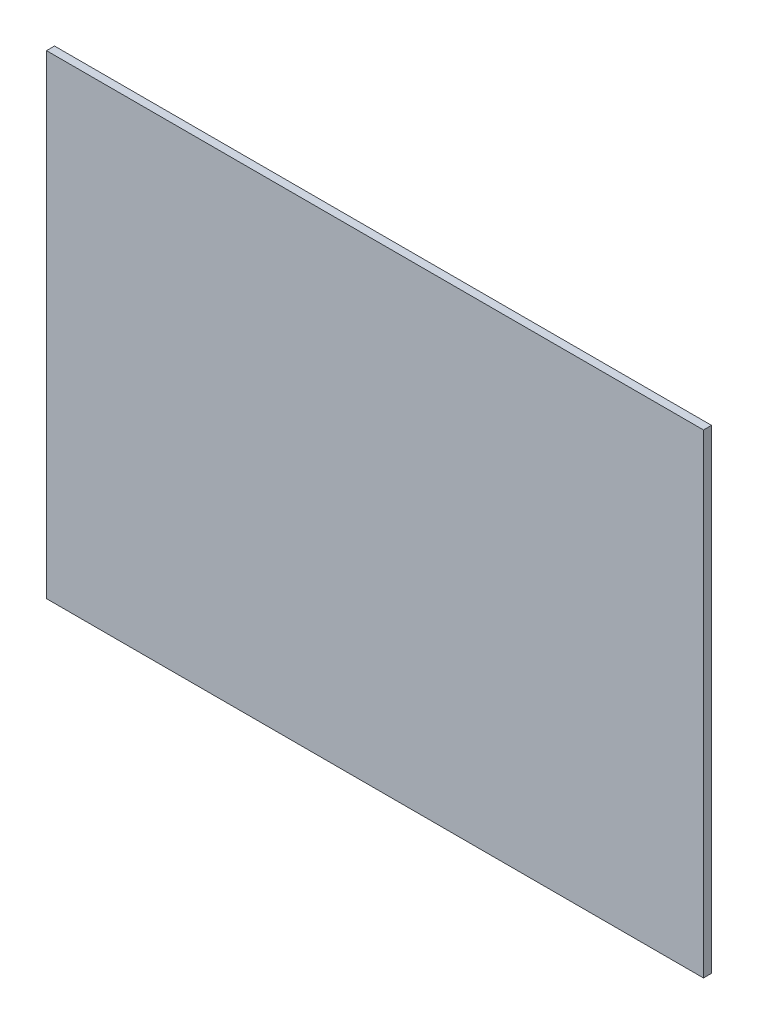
ISO-10303-21;
HEADER;
FILE_DESCRIPTION(('STEP AP214'),'2;1');
FILE_NAME('part.step','',(''),(''),'','','');
FILE_SCHEMA(('AUTOMOTIVE_DESIGN { 1 0 10303 214 1 1 1 1 }'));
ENDSEC;
DATA;
#1=APPLICATION_CONTEXT('core data for automotive mechanical design processes');
#2=APPLICATION_PROTOCOL_DEFINITION('international standard','automotive_design',2000,#1);
#3=PRODUCT_CONTEXT('',#1,'mechanical');
#4=PRODUCT('Part','Part','',(#3));
#5=PRODUCT_RELATED_PRODUCT_CATEGORY('part','',(#4));
#6=PRODUCT_DEFINITION_FORMATION('','',#4);
#7=PRODUCT_DEFINITION_CONTEXT('part definition',#1,'design');
#8=PRODUCT_DEFINITION('design','',#6,#7);
#9=PRODUCT_DEFINITION_SHAPE('','',#8);
#10=(LENGTH_UNIT() NAMED_UNIT(*) SI_UNIT(.MILLI.,.METRE.));
#11=(NAMED_UNIT(*) PLANE_ANGLE_UNIT() SI_UNIT($,.RADIAN.));
#12=(NAMED_UNIT(*) SI_UNIT($,.STERADIAN.) SOLID_ANGLE_UNIT());
#13=UNCERTAINTY_MEASURE_WITH_UNIT(LENGTH_MEASURE(1.E-05),#10,'distance_accuracy_value','');
#14=(GEOMETRIC_REPRESENTATION_CONTEXT(3) GLOBAL_UNCERTAINTY_ASSIGNED_CONTEXT((#13)) GLOBAL_UNIT_ASSIGNED_CONTEXT((#10,
#11,#12)) REPRESENTATION_CONTEXT('',''));
#15=CARTESIAN_POINT('',(0.,0.,0.));
#16=DIRECTION('',(0.,0.,1.));
#17=DIRECTION('',(1.,0.,0.));
#18=AXIS2_PLACEMENT_3D('',#15,#16,#17);
#19=CARTESIAN_POINT('',(-106.115880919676,72.9438133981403,2.));
#20=DIRECTION('',(1.,0.,0.));
#21=DIRECTION('',(0.,0.,-1.));
#22=AXIS2_PLACEMENT_3D('',#19,#20,#21);
#23=PLANE('',#22);
#24=DIRECTION('',(0.,-1.,0.));
#25=VECTOR('',#24,1.);
#26=CARTESIAN_POINT('',(-106.115880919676,72.9438133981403,0.));
#27=LINE('',#26,#25);
#28=CARTESIAN_POINT('',(-106.115880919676,72.9438133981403,0.));
#29=VERTEX_POINT('',#28);
#30=CARTESIAN_POINT('',(-106.115880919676,-45.5030455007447,0.));
#31=VERTEX_POINT('',#30);
#32=EDGE_CURVE('E98',#29,#31,#27,.T.);
#33=ORIENTED_EDGE('',*,*,#32,.T.);
#34=DIRECTION('',(0.,0.,-1.));
#35=VECTOR('',#34,1.);
#36=CARTESIAN_POINT('',(-106.115880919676,-45.5030455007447,2.));
#37=LINE('',#36,#35);
#38=CARTESIAN_POINT('',(-106.115880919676,-45.5030455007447,2.));
#39=VERTEX_POINT('',#38);
#40=EDGE_CURVE('E11',#39,#31,#37,.T.);
#41=ORIENTED_EDGE('',*,*,#40,.F.);
#42=DIRECTION('',(0.,-1.,0.));
#43=VECTOR('',#42,1.);
#44=CARTESIAN_POINT('',(-106.115880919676,72.9438133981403,2.));
#45=LINE('',#44,#43);
#46=CARTESIAN_POINT('',(-106.115880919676,72.9438133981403,2.));
#47=VERTEX_POINT('',#46);
#48=EDGE_CURVE('E86',#47,#39,#45,.T.);
#49=ORIENTED_EDGE('',*,*,#48,.F.);
#50=DIRECTION('',(0.,0.,-1.));
#51=VECTOR('',#50,1.);
#52=CARTESIAN_POINT('',(-106.115880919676,72.9438133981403,2.));
#53=LINE('',#52,#51);
#54=EDGE_CURVE('E94',#47,#29,#53,.T.);
#55=ORIENTED_EDGE('',*,*,#54,.T.);
#56=EDGE_LOOP('',(#33,#41,#49,#55));
#57=FACE_BOUND('',#56,.T.);
#58=ADVANCED_FACE('F35',(#57),#23,.F.);
#59=CARTESIAN_POINT('',(-106.115880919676,-45.5030455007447,2.));
#60=DIRECTION('',(0.,1.,0.));
#61=DIRECTION('',(0.,0.,1.));
#62=AXIS2_PLACEMENT_3D('',#59,#60,#61);
#63=PLANE('',#62);
#64=DIRECTION('',(1.,0.,0.));
#65=VECTOR('',#64,1.);
#66=CARTESIAN_POINT('',(-106.115880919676,-45.5030455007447,0.));
#67=LINE('',#66,#65);
#68=CARTESIAN_POINT('',(57.8340234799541,-45.5030455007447,0.));
#69=VERTEX_POINT('',#68);
#70=EDGE_CURVE('E90',#31,#69,#67,.T.);
#71=ORIENTED_EDGE('',*,*,#70,.T.);
#72=DIRECTION('',(0.,0.,-1.));
#73=VECTOR('',#72,1.);
#74=CARTESIAN_POINT('',(57.8340234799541,-45.5030455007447,2.));
#75=LINE('',#74,#73);
#76=CARTESIAN_POINT('',(57.8340234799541,-45.5030455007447,2.));
#77=VERTEX_POINT('',#76);
#78=EDGE_CURVE('E43',#77,#69,#75,.T.);
#79=ORIENTED_EDGE('',*,*,#78,.F.);
#80=DIRECTION('',(1.,0.,0.));
#81=VECTOR('',#80,1.);
#82=CARTESIAN_POINT('',(-106.115880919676,-45.5030455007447,2.));
#83=LINE('',#82,#81);
#84=EDGE_CURVE('E81',#39,#77,#83,.T.);
#85=ORIENTED_EDGE('',*,*,#84,.F.);
#86=ORIENTED_EDGE('',*,*,#40,.T.);
#87=EDGE_LOOP('',(#71,#79,#85,#86));
#88=FACE_BOUND('',#87,.T.);
#89=ADVANCED_FACE('F89',(#88),#63,.F.);
#90=CARTESIAN_POINT('',(57.8340234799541,72.9438133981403,2.));
#91=DIRECTION('',(-1.,0.,0.));
#92=DIRECTION('',(0.,0.,1.));
#93=AXIS2_PLACEMENT_3D('',#90,#91,#92);
#94=PLANE('',#93);
#95=DIRECTION('',(0.,1.,0.));
#96=VECTOR('',#95,1.);
#97=CARTESIAN_POINT('',(57.8340234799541,72.9438133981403,0.));
#98=LINE('',#97,#96);
#99=CARTESIAN_POINT('',(57.8340234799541,72.9438133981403,0.));
#100=VERTEX_POINT('',#99);
#101=EDGE_CURVE('E68',#69,#100,#98,.T.);
#102=ORIENTED_EDGE('',*,*,#101,.T.);
#103=DIRECTION('',(0.,0.,-1.));
#104=VECTOR('',#103,1.);
#105=CARTESIAN_POINT('',(57.8340234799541,72.9438133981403,2.));
#106=LINE('',#105,#104);
#107=CARTESIAN_POINT('',(57.8340234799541,72.9438133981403,2.));
#108=VERTEX_POINT('',#107);
#109=EDGE_CURVE('E91',#108,#100,#106,.T.);
#110=ORIENTED_EDGE('',*,*,#109,.F.);
#111=DIRECTION('',(0.,1.,0.));
#112=VECTOR('',#111,1.);
#113=CARTESIAN_POINT('',(57.8340234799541,72.9438133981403,2.));
#114=LINE('',#113,#112);
#115=EDGE_CURVE('E84',#77,#108,#114,.T.);
#116=ORIENTED_EDGE('',*,*,#115,.F.);
#117=ORIENTED_EDGE('',*,*,#78,.T.);
#118=EDGE_LOOP('',(#102,#110,#116,#117));
#119=FACE_BOUND('',#118,.T.);
#120=ADVANCED_FACE('F92',(#119),#94,.F.);
#121=CARTESIAN_POINT('',(-106.115880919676,72.9438133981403,2.));
#122=DIRECTION('',(0.,-1.,0.));
#123=DIRECTION('',(0.,0.,-1.));
#124=AXIS2_PLACEMENT_3D('',#121,#122,#123);
#125=PLANE('',#124);
#126=DIRECTION('',(-1.,0.,0.));
#127=VECTOR('',#126,1.);
#128=CARTESIAN_POINT('',(-106.115880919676,72.9438133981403,0.));
#129=LINE('',#128,#127);
#130=EDGE_CURVE('E74',#100,#29,#129,.T.);
#131=ORIENTED_EDGE('',*,*,#130,.T.);
#132=ORIENTED_EDGE('',*,*,#54,.F.);
#133=DIRECTION('',(-1.,0.,0.));
#134=VECTOR('',#133,1.);
#135=CARTESIAN_POINT('',(-106.115880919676,72.9438133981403,2.));
#136=LINE('',#135,#134);
#137=EDGE_CURVE('E51',#108,#47,#136,.T.);
#138=ORIENTED_EDGE('',*,*,#137,.F.);
#139=ORIENTED_EDGE('',*,*,#109,.T.);
#140=EDGE_LOOP('',(#131,#132,#138,#139));
#141=FACE_BOUND('',#140,.T.);
#142=ADVANCED_FACE('F105',(#141),#125,.F.);
#143=CARTESIAN_POINT('',(-106.115880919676,-45.5030455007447,2.));
#144=DIRECTION('',(0.,0.,1.));
#145=DIRECTION('',(1.,0.,0.));
#146=AXIS2_PLACEMENT_3D('',#143,#144,#145);
#147=PLANE('',#146);
#148=ORIENTED_EDGE('',*,*,#48,.T.);
#149=ORIENTED_EDGE('',*,*,#84,.T.);
#150=ORIENTED_EDGE('',*,*,#115,.T.);
#151=ORIENTED_EDGE('',*,*,#137,.T.);
#152=EDGE_LOOP('',(#148,#149,#150,#151));
#153=FACE_BOUND('',#152,.T.);
#154=ADVANCED_FACE('F82',(#153),#147,.T.);
#155=CARTESIAN_POINT('',(-106.115880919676,-45.5030455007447,0.));
#156=DIRECTION('',(0.,0.,1.));
#157=DIRECTION('',(1.,0.,0.));
#158=AXIS2_PLACEMENT_3D('',#155,#156,#157);
#159=PLANE('',#158);
#160=ORIENTED_EDGE('',*,*,#32,.F.);
#161=ORIENTED_EDGE('',*,*,#130,.F.);
#162=ORIENTED_EDGE('',*,*,#101,.F.);
#163=ORIENTED_EDGE('',*,*,#70,.F.);
#164=EDGE_LOOP('',(#160,#161,#162,#163));
#165=FACE_BOUND('',#164,.T.);
#166=ADVANCED_FACE('F108',(#165),#159,.F.);
#167=CLOSED_SHELL('',(#58,#89,#120,#142,#154,#166));
#168=MANIFOLD_SOLID_BREP('B2',#167);
#169=ADVANCED_BREP_SHAPE_REPRESENTATION('',(#18,#168),#14);
#170=SHAPE_DEFINITION_REPRESENTATION(#9,#169);
ENDSEC;
END-ISO-10303-21;
